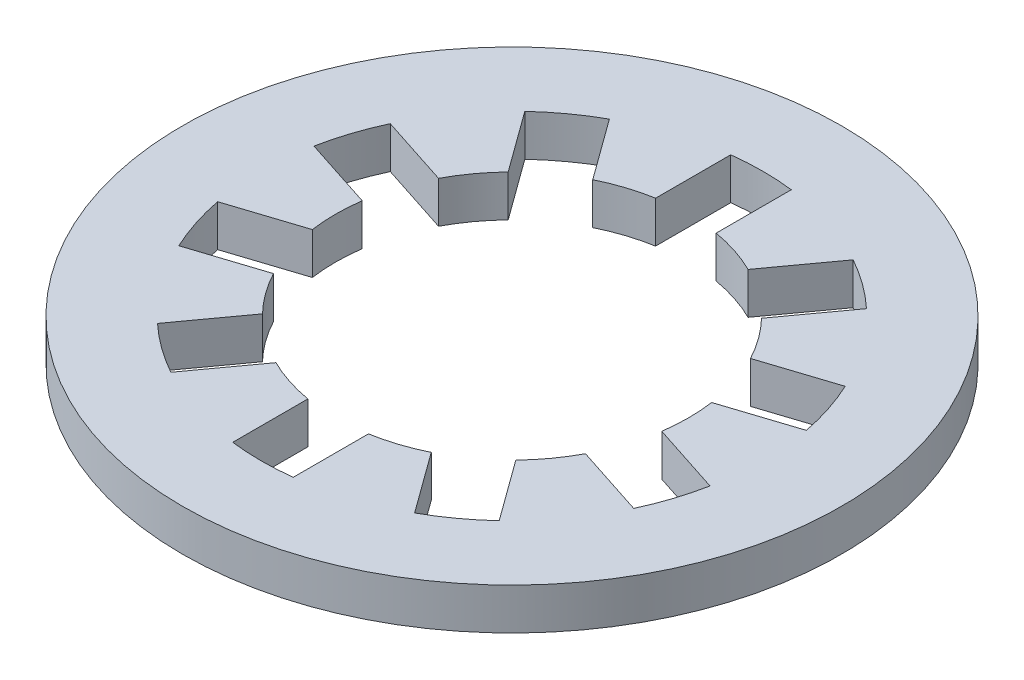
from build123d import *

# Parameters (mm, degrees)
SKETCH1_R           = 4.8387
BOSS_EXTRUDE1_DEPTH = 0.6096
CUT_EXTRUDE1_DEPTH  = 7.870054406
SKETCH3_R           = 2.5908
CUT_EXTRUDE2_DEPTH  = 2.54


with BuildPart() as part:
    # Sketch1 → Boss-Extrude1 (new body)
    with BuildSketch(Plane(origin=(0, 0, 0), x_dir=(1, 0, 0), z_dir=(0, 1, 0))):
        with Locations(Location((0, 0, 0), (0, 0, 270))):
            Circle(SKETCH1_R)
    extrude(amount=BOSS_EXTRUDE1_DEPTH)

    # Sketch2 → Cut-Extrude1 (cut, through all)
    with BuildSketch(Plane(origin=(0, 0.6096, 0), x_dir=(1, 0, 0), z_dir=(0, 1, 0))):
        with BuildLine():
            Line((1.140645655, 2.326192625), (1.789380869, 3.219100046))
            ThreePointArc((1.789380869, 3.219100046), (2.164813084, 2.97960959), (2.508596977, 2.696558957))
            Line((2.508596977, 2.696558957), (1.859861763, 1.803651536))
            ThreePointArc((1.859861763, 1.803651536), (1.522834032, 2.096001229), (1.140645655, 2.326192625))
        make_face()
        with BuildLine():
            Line((2.290103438, 1.211474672), (3.339779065, 1.552534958))
            ThreePointArc((3.339779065, 1.552534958), (3.50274115, 1.13810959), (3.614495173, 0.707045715))
            Line((3.614495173, 0.707045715), (2.564819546, 0.365985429))
            ThreePointArc((2.564819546, 0.365985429), (2.463997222, 0.800601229), (2.290103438, 1.211474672))
        make_face()
        with BuildLine():
            Line((-0.4445, 2.55238406), (-0.4445, 3.656078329))
            ThreePointArc((-0.4445, 3.656078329), (0, 3.683), (0.4445, 3.656078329))
            Line((0.4445, 3.656078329), (0.4445, 2.55238406))
            ThreePointArc((0.4445, 2.55238406), (0, 2.5908), (-0.4445, 2.55238406))
        make_face()
        with BuildLine():
            Line((2.564819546, -0.365985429), (3.614495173, -0.707045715))
            ThreePointArc((3.614495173, -0.707045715), (3.50274115, -1.13810959), (3.339779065, -1.552534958))
            Line((3.339779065, -1.552534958), (2.290103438, -1.211474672))
            ThreePointArc((2.290103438, -1.211474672), (2.463997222, -0.800601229), (2.564819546, -0.365985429))
        make_face()
        with BuildLine():
            Line((1.859861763, -1.803651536), (2.508596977, -2.696558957))
            ThreePointArc((2.508596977, -2.696558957), (2.164813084, -2.97960959), (1.789380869, -3.219100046))
            Line((1.789380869, -3.219100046), (1.140645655, -2.326192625))
            ThreePointArc((1.140645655, -2.326192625), (1.522834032, -2.096001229), (1.859861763, -1.803651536))
        make_face()
        with BuildLine():
            Line((0.4445, -2.55238406), (0.4445, -3.656078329))
            ThreePointArc((0.4445, -3.656078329), (0, -3.683), (-0.4445, -3.656078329))
            Line((-0.4445, -3.656078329), (-0.4445, -2.55238406))
            ThreePointArc((-0.4445, -2.55238406), (0, -2.5908), (0.4445, -2.55238406))
        make_face()
        with BuildLine():
            Line((-1.140645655, -2.326192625), (-1.789380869, -3.219100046))
            ThreePointArc((-1.789380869, -3.219100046), (-2.164813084, -2.97960959), (-2.508596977, -2.696558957))
            Line((-2.508596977, -2.696558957), (-1.859861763, -1.803651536))
            ThreePointArc((-1.859861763, -1.803651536), (-1.522834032, -2.096001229), (-1.140645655, -2.326192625))
        make_face()
        with BuildLine():
            Line((-2.290103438, -1.211474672), (-3.339779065, -1.552534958))
            ThreePointArc((-3.339779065, -1.552534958), (-3.50274115, -1.13810959), (-3.614495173, -0.707045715))
            Line((-3.614495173, -0.707045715), (-2.564819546, -0.365985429))
            ThreePointArc((-2.564819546, -0.365985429), (-2.463997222, -0.800601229), (-2.290103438, -1.211474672))
        make_face()
        with BuildLine():
            Line((-2.564819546, 0.365985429), (-3.614495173, 0.707045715))
            ThreePointArc((-3.614495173, 0.707045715), (-3.50274115, 1.13810959), (-3.339779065, 1.552534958))
            Line((-3.339779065, 1.552534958), (-2.290103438, 1.211474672))
            ThreePointArc((-2.290103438, 1.211474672), (-2.463997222, 0.800601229), (-2.564819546, 0.365985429))
        make_face()
        with BuildLine():
            Line((-1.859861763, 1.803651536), (-2.508596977, 2.696558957))
            ThreePointArc((-2.508596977, 2.696558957), (-2.164813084, 2.97960959), (-1.789380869, 3.219100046))
            Line((-1.789380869, 3.219100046), (-1.140645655, 2.326192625))
            ThreePointArc((-1.140645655, 2.326192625), (-1.522834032, 2.096001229), (-1.859861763, 1.803651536))
        make_face()
    extrude(amount=-CUT_EXTRUDE1_DEPTH, mode=Mode.SUBTRACT)

    # Sketch3 → Cut-Extrude2 (cut)
    with BuildSketch(Plane(origin=(0, 0.6096, 0), x_dir=(1, 0, 0), z_dir=(0, 1, 0))):
        Circle(SKETCH3_R)
    extrude(amount=-CUT_EXTRUDE2_DEPTH, mode=Mode.SUBTRACT)


solid = part.part
